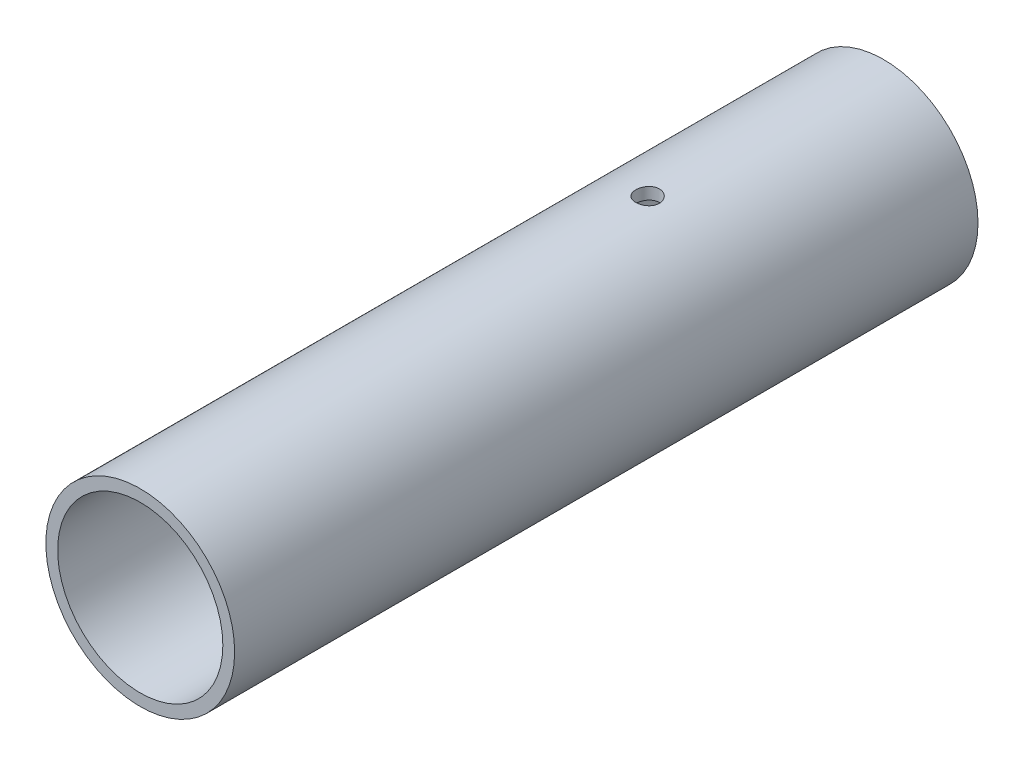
ISO-10303-21;
HEADER;
FILE_DESCRIPTION(('STEP AP214'),'2;1');
FILE_NAME('part.step','',(''),(''),'','','');
FILE_SCHEMA(('AUTOMOTIVE_DESIGN { 1 0 10303 214 1 1 1 1 }'));
ENDSEC;
DATA;
#1=APPLICATION_CONTEXT('core data for automotive mechanical design processes');
#2=APPLICATION_PROTOCOL_DEFINITION('international standard','automotive_design',2000,#1);
#3=PRODUCT_CONTEXT('',#1,'mechanical');
#4=PRODUCT('Part','Part','',(#3));
#5=PRODUCT_RELATED_PRODUCT_CATEGORY('part','',(#4));
#6=PRODUCT_DEFINITION_FORMATION('','',#4);
#7=PRODUCT_DEFINITION_CONTEXT('part definition',#1,'design');
#8=PRODUCT_DEFINITION('design','',#6,#7);
#9=PRODUCT_DEFINITION_SHAPE('','',#8);
#10=(LENGTH_UNIT() NAMED_UNIT(*) SI_UNIT(.MILLI.,.METRE.));
#11=(NAMED_UNIT(*) PLANE_ANGLE_UNIT() SI_UNIT($,.RADIAN.));
#12=(NAMED_UNIT(*) SI_UNIT($,.STERADIAN.) SOLID_ANGLE_UNIT());
#13=UNCERTAINTY_MEASURE_WITH_UNIT(LENGTH_MEASURE(1.E-05),#10,'distance_accuracy_value','');
#14=(GEOMETRIC_REPRESENTATION_CONTEXT(3) GLOBAL_UNCERTAINTY_ASSIGNED_CONTEXT((#13)) GLOBAL_UNIT_ASSIGNED_CONTEXT((#10,
#11,#12)) REPRESENTATION_CONTEXT('',''));
#15=CARTESIAN_POINT('',(0.,0.,0.));
#16=DIRECTION('',(0.,0.,1.));
#17=DIRECTION('',(1.,0.,0.));
#18=AXIS2_PLACEMENT_3D('',#15,#16,#17);
#19=CARTESIAN_POINT('',(0.,0.,63.));
#20=DIRECTION('',(0.,0.,1.));
#21=DIRECTION('',(1.,0.,0.));
#22=AXIS2_PLACEMENT_3D('',#19,#20,#21);
#23=PLANE('',#22);
#24=CARTESIAN_POINT('',(0.,0.,63.));
#25=DIRECTION('',(0.,0.,1.));
#26=DIRECTION('',(1.,0.,0.));
#27=AXIS2_PLACEMENT_3D('',#24,#25,#26);
#28=CIRCLE('',#27,8.);
#29=CARTESIAN_POINT('',(8.,0.,63.));
#30=VERTEX_POINT('',#29);
#31=EDGE_CURVE('E10',#30,#30,#28,.T.);
#32=ORIENTED_EDGE('',*,*,#31,.T.);
#33=EDGE_LOOP('',(#32));
#34=FACE_BOUND('',#33,.T.);
#35=CARTESIAN_POINT('',(0.,0.,63.));
#36=DIRECTION('',(0.,0.,1.));
#37=DIRECTION('',(1.,0.,0.));
#38=AXIS2_PLACEMENT_3D('',#35,#36,#37);
#39=CIRCLE('',#38,7.);
#40=CARTESIAN_POINT('',(7.,0.,63.));
#41=VERTEX_POINT('',#40);
#42=EDGE_CURVE('E48',#41,#41,#39,.T.);
#43=ORIENTED_EDGE('',*,*,#42,.F.);
#44=EDGE_LOOP('',(#43));
#45=FACE_BOUND('',#44,.T.);
#46=ADVANCED_FACE('F30',(#34,#45),#23,.T.);
#47=CARTESIAN_POINT('',(0.,0.,0.));
#48=DIRECTION('',(0.,0.,1.));
#49=DIRECTION('',(1.,0.,0.));
#50=AXIS2_PLACEMENT_3D('',#47,#48,#49);
#51=PLANE('',#50);
#52=CARTESIAN_POINT('',(0.,0.,0.));
#53=DIRECTION('',(0.,0.,1.));
#54=DIRECTION('',(1.,0.,0.));
#55=AXIS2_PLACEMENT_3D('',#52,#53,#54);
#56=CIRCLE('',#55,8.);
#57=CARTESIAN_POINT('',(8.00000000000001,0.,0.));
#58=VERTEX_POINT('',#57);
#59=EDGE_CURVE('E43',#58,#58,#56,.T.);
#60=ORIENTED_EDGE('',*,*,#59,.F.);
#61=EDGE_LOOP('',(#60));
#62=FACE_BOUND('',#61,.T.);
#63=CARTESIAN_POINT('',(0.,0.,0.));
#64=DIRECTION('',(0.,0.,1.));
#65=DIRECTION('',(1.,0.,0.));
#66=AXIS2_PLACEMENT_3D('',#63,#64,#65);
#67=CIRCLE('',#66,7.);
#68=CARTESIAN_POINT('',(7.00000000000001,0.,0.));
#69=VERTEX_POINT('',#68);
#70=EDGE_CURVE('E77',#69,#69,#67,.T.);
#71=ORIENTED_EDGE('',*,*,#70,.T.);
#72=EDGE_LOOP('',(#71));
#73=FACE_BOUND('',#72,.T.);
#74=ADVANCED_FACE('F85',(#62,#73),#51,.F.);
#75=CARTESIAN_POINT('',(0.,0.,63.));
#76=DIRECTION('',(0.,0.,-1.));
#77=DIRECTION('',(-1.,0.,0.));
#78=AXIS2_PLACEMENT_3D('',#75,#76,#77);
#79=CYLINDRICAL_SURFACE('',#78,8.);
#80=CARTESIAN_POINT('',(0.,-8.,21.));
#81=CARTESIAN_POINT('',(0.0559364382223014,-7.99999921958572,20.9999976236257));
#82=CARTESIAN_POINT('',(0.111907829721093,-7.99940713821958,20.9952908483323));
#83=CARTESIAN_POINT('',(0.222293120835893,-7.99710216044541,20.9765888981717));
#84=CARTESIAN_POINT('',(0.276705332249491,-7.99538809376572,20.9625840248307));
#85=CARTESIAN_POINT('',(0.382358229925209,-7.99103224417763,20.9257049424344));
#86=CARTESIAN_POINT('',(0.433601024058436,-7.98839108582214,20.9028367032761));
#87=CARTESIAN_POINT('',(0.531511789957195,-7.98247480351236,20.8488930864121));
#88=CARTESIAN_POINT('',(0.578180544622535,-7.97919978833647,20.8178191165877));
#89=CARTESIAN_POINT('',(0.665885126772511,-7.97236128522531,20.7481632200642));
#90=CARTESIAN_POINT('',(0.706892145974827,-7.96879645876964,20.7095451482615));
#91=CARTESIAN_POINT('',(0.781861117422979,-7.96179090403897,20.6259748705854));
#92=CARTESIAN_POINT('',(0.815822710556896,-7.95835018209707,20.5810223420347));
#93=CARTESIAN_POINT('',(0.875844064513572,-7.95196922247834,20.4858720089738));
#94=CARTESIAN_POINT('',(0.901876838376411,-7.94903070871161,20.4356570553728));
#95=CARTESIAN_POINT('',(0.945129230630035,-7.9440045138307,20.3315251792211));
#96=CARTESIAN_POINT('',(0.962349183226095,-7.94191680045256,20.2776083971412));
#97=CARTESIAN_POINT('',(0.987399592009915,-7.93884135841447,20.1679023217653));
#98=CARTESIAN_POINT('',(0.995278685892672,-7.93784793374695,20.1121242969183));
#99=CARTESIAN_POINT('',(1.00157421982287,-7.93705611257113,20.0000294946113));
#100=CARTESIAN_POINT('',(0.999991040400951,-7.93725766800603,19.9437127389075));
#101=CARTESIAN_POINT('',(0.987446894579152,-7.93882782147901,19.8324780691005));
#102=CARTESIAN_POINT('',(0.976539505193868,-7.94018975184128,19.7775540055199));
#103=CARTESIAN_POINT('',(0.945740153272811,-7.94391679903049,19.6703219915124));
#104=CARTESIAN_POINT('',(0.925848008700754,-7.94628193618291,19.6180140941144));
#105=CARTESIAN_POINT('',(0.877586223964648,-7.95175646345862,19.5173328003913));
#106=CARTESIAN_POINT('',(0.849193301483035,-7.95486789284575,19.4689706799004));
#107=CARTESIAN_POINT('',(0.784752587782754,-7.96148284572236,19.3776773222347));
#108=CARTESIAN_POINT('',(0.748704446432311,-7.96498638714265,19.3347463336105));
#109=CARTESIAN_POINT('',(0.669679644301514,-7.9720204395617,19.2552229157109));
#110=CARTESIAN_POINT('',(0.626656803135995,-7.97555096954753,19.2186763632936));
#111=CARTESIAN_POINT('',(0.535062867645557,-7.98221853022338,19.1533164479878));
#112=CARTESIAN_POINT('',(0.486491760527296,-7.98535556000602,19.1245031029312));
#113=CARTESIAN_POINT('',(0.385144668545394,-7.99088460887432,19.0754274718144));
#114=CARTESIAN_POINT('',(0.332367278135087,-7.99327637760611,19.0551680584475));
#115=CARTESIAN_POINT('',(0.224123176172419,-7.99704314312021,19.0238118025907));
#116=CARTESIAN_POINT('',(0.168656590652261,-7.99841818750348,19.0127145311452));
#117=CARTESIAN_POINT('',(0.0570052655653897,-7.99999038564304,19.0000570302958));
#118=CARTESIAN_POINT('',(0.000827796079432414,-8.00019534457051,18.9984336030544));
#119=CARTESIAN_POINT('',(-0.110998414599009,-7.99942535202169,19.0046030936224));
#120=CARTESIAN_POINT('',(-0.166647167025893,-7.99845042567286,19.0123958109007));
#121=CARTESIAN_POINT('',(-0.275649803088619,-7.99543507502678,19.0371238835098));
#122=CARTESIAN_POINT('',(-0.329010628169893,-7.99339816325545,19.0540291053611));
#123=CARTESIAN_POINT('',(-0.43213986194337,-7.98848689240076,19.0964709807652));
#124=CARTESIAN_POINT('',(-0.481908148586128,-7.98561250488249,19.1220079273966));
#125=CARTESIAN_POINT('',(-0.57672180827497,-7.97932729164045,19.181141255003));
#126=CARTESIAN_POINT('',(-0.621741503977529,-7.97591377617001,19.2147785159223));
#127=CARTESIAN_POINT('',(-0.705518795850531,-7.9689405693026,19.2890997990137));
#128=CARTESIAN_POINT('',(-0.744276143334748,-7.96538087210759,19.3297841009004));
#129=CARTESIAN_POINT('',(-0.814652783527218,-7.95849242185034,19.4173229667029));
#130=CARTESIAN_POINT('',(-0.84623018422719,-7.95516509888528,19.4642113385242));
#131=CARTESIAN_POINT('',(-0.901061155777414,-7.94914164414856,19.5626632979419));
#132=CARTESIAN_POINT('',(-0.924314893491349,-7.94644549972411,19.6142267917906));
#133=CARTESIAN_POINT('',(-0.961770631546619,-7.94199940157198,19.7204301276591));
#134=CARTESIAN_POINT('',(-0.975996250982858,-7.94024698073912,19.7750615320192));
#135=CARTESIAN_POINT('',(-0.995067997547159,-7.93787966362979,19.8859609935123));
#136=CARTESIAN_POINT('',(-0.99991456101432,-7.93726471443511,19.9422289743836));
#137=CARTESIAN_POINT('',(-1.00008261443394,-7.93724350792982,20.0543875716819));
#138=CARTESIAN_POINT('',(-0.995469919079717,-7.93782889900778,20.1102780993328));
#139=CARTESIAN_POINT('',(-0.976989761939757,-7.94012445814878,20.220482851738));
#140=CARTESIAN_POINT('',(-0.963122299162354,-7.94183462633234,20.2747970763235));
#141=CARTESIAN_POINT('',(-0.926546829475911,-7.94618446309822,20.3802987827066));
#142=CARTESIAN_POINT('',(-0.903841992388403,-7.94882379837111,20.4314873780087));
#143=CARTESIAN_POINT('',(-0.850242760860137,-7.95473513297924,20.5293386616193));
#144=CARTESIAN_POINT('',(-0.819348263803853,-7.95800714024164,20.5760012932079));
#145=CARTESIAN_POINT('',(-0.750002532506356,-7.96484241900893,20.6638124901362));
#146=CARTESIAN_POINT('',(-0.711502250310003,-7.9684074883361,20.704922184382));
#147=CARTESIAN_POINT('',(-0.628140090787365,-7.97541132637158,20.7801227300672));
#148=CARTESIAN_POINT('',(-0.583276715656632,-7.97885006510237,20.8142119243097));
#149=CARTESIAN_POINT('',(-0.488266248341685,-7.98522822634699,20.8745141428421));
#150=CARTESIAN_POINT('',(-0.438099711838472,-7.98816570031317,20.9006967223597));
#151=CARTESIAN_POINT('',(-0.33407316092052,-7.99319059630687,20.9442284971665));
#152=CARTESIAN_POINT('',(-0.280217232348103,-7.99527894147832,20.9615872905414));
#153=CARTESIAN_POINT('',(-0.188402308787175,-7.99786688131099,20.9828237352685));
#154=CARTESIAN_POINT('',(-0.15102226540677,-7.99866290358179,20.9892555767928));
#155=CARTESIAN_POINT('',(-0.0757668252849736,-7.99972972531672,20.9978444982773));
#156=CARTESIAN_POINT('',(-0.0378914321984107,-8.00000052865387,21.0000016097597));
#157=CARTESIAN_POINT('',(0.,-8.,21.));
#158=B_SPLINE_CURVE_WITH_KNOTS('',3,(#80,#81,#82,#83,#84,#85,#86,#87,#88,#89,#90,#91,#92,#93,
#94,#95,#96,#97,#98,#99,#100,#101,#102,#103,#104,#105,#106,#107,#108,#109,#110,#111,#112,#113,
#114,#115,#116,#117,#118,#119,#120,#121,#122,#123,#124,#125,#126,#127,#128,#129,#130,#131,#132,
#133,#134,#135,#136,#137,#138,#139,#140,#141,#142,#143,#144,#145,#146,#147,#148,#149,#150,#151,
#152,#153,#154,#155,#156,#157),.UNSPECIFIED.,.T.,.F.,(4,2,2,2,2,2,2,2,2,2,2,2,2,2,2,2,2,2,2,2,2,
2,2,2,2,2,2,2,2,2,2,2,2,2,2,2,2,2,4),(0.,0.167670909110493,0.335516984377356,0.503250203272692,
0.670954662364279,0.839483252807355,1.00802043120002,1.17712500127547,1.34622315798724,
1.51443690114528,1.68264387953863,1.84989078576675,2.01714108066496,2.18485370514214,
2.35257400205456,2.52145391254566,2.69033421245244,2.85927118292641,3.02820024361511,
3.19600111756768,3.36379841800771,3.53104421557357,3.69829569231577,3.86640961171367,
4.03453020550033,4.20360788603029,4.37268217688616,4.5413122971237,4.70993457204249,
4.87738760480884,5.04484065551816,5.21223369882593,5.37962883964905,5.54814095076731,
5.71669279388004,5.88588561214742,6.05489399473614,6.16847537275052,6.28205591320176),.UNSPECIFIED.);
#159=CARTESIAN_POINT('',(0.,-8.,21.));
#160=VERTEX_POINT('',#159);
#161=EDGE_CURVE('E72',#160,#160,#158,.T.);
#162=ORIENTED_EDGE('',*,*,#161,.T.);
#163=EDGE_LOOP('',(#162));
#164=FACE_BOUND('',#163,.T.);
#165=CARTESIAN_POINT('',(0.,8.00000000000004,21.));
#166=CARTESIAN_POINT('',(-0.0559364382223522,7.99999921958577,20.9999976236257));
#167=CARTESIAN_POINT('',(-0.111907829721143,7.99940713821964,20.9952908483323));
#168=CARTESIAN_POINT('',(-0.222293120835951,7.99710216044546,20.9765888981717));
#169=CARTESIAN_POINT('',(-0.276705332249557,7.99538809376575,20.9625840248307));
#170=CARTESIAN_POINT('',(-0.382358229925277,7.99103224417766,20.9257049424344));
#171=CARTESIAN_POINT('',(-0.433601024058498,7.98839108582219,20.9028367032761));
#172=CARTESIAN_POINT('',(-0.531511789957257,7.98247480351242,20.8488930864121));
#173=CARTESIAN_POINT('',(-0.578180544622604,7.97919978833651,20.8178191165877));
#174=CARTESIAN_POINT('',(-0.665885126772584,7.97236128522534,20.7481632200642));
#175=CARTESIAN_POINT('',(-0.706892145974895,7.96879645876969,20.7095451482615));
#176=CARTESIAN_POINT('',(-0.781861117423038,7.96179090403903,20.6259748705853));
#177=CARTESIAN_POINT('',(-0.815822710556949,7.95835018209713,20.5810223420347));
#178=CARTESIAN_POINT('',(-0.875844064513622,7.95196922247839,20.4858720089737));
#179=CARTESIAN_POINT('',(-0.901876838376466,7.94903070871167,20.4356570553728));
#180=CARTESIAN_POINT('',(-0.945129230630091,7.94400451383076,20.331525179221));
#181=CARTESIAN_POINT('',(-0.962349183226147,7.94191680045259,20.2776083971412));
#182=CARTESIAN_POINT('',(-0.987399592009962,7.93884135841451,20.1679023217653));
#183=CARTESIAN_POINT('',(-0.995278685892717,7.93784793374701,20.1121242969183));
#184=CARTESIAN_POINT('',(-1.00157421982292,7.93705611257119,20.0000294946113));
#185=CARTESIAN_POINT('',(-0.999991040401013,7.93725766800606,19.9437127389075));
#186=CARTESIAN_POINT('',(-0.987446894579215,7.93882782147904,19.8324780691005));
#187=CARTESIAN_POINT('',(-0.976539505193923,7.94018975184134,19.7775540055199));
#188=CARTESIAN_POINT('',(-0.945740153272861,7.94391679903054,19.6703219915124));
#189=CARTESIAN_POINT('',(-0.925848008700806,7.94628193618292,19.6180140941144));
#190=CARTESIAN_POINT('',(-0.877586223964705,7.95175646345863,19.5173328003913));
#191=CARTESIAN_POINT('',(-0.849193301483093,7.9548678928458,19.4689706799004));
#192=CARTESIAN_POINT('',(-0.784752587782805,7.96148284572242,19.3776773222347));
#193=CARTESIAN_POINT('',(-0.748704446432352,7.96498638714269,19.3347463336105));
#194=CARTESIAN_POINT('',(-0.669679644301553,7.97202043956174,19.2552229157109));
#195=CARTESIAN_POINT('',(-0.626656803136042,7.9755509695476,19.2186763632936));
#196=CARTESIAN_POINT('',(-0.535062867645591,7.98221853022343,19.1533164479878));
#197=CARTESIAN_POINT('',(-0.486491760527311,7.98535556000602,19.1245031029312));
#198=CARTESIAN_POINT('',(-0.385144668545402,7.99088460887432,19.0754274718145));
#199=CARTESIAN_POINT('',(-0.332367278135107,7.99327637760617,19.0551680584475));
#200=CARTESIAN_POINT('',(-0.224123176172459,7.99704314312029,19.0238118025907));
#201=CARTESIAN_POINT('',(-0.168656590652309,7.99841818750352,19.0127145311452));
#202=CARTESIAN_POINT('',(-0.0570052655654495,7.99999038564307,19.0000570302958));
#203=CARTESIAN_POINT('',(-0.000827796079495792,8.00019534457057,18.9984336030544));
#204=CARTESIAN_POINT('',(0.110998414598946,7.99942535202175,19.0046030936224));
#205=CARTESIAN_POINT('',(0.166647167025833,7.99845042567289,19.0123958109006));
#206=CARTESIAN_POINT('',(0.275649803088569,7.99543507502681,19.0371238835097));
#207=CARTESIAN_POINT('',(0.329010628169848,7.99339816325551,19.054029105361));
#208=CARTESIAN_POINT('',(0.432139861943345,7.98848689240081,19.0964709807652));
#209=CARTESIAN_POINT('',(0.481908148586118,7.9856125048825,19.1220079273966));
#210=CARTESIAN_POINT('',(0.576721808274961,7.97932729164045,19.181141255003));
#211=CARTESIAN_POINT('',(0.621741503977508,7.97591377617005,19.2147785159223));
#212=CARTESIAN_POINT('',(0.705518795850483,7.96894056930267,19.2890997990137));
#213=CARTESIAN_POINT('',(0.744276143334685,7.96538087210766,19.3297841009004));
#214=CARTESIAN_POINT('',(0.814652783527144,7.95849242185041,19.4173229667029));
#215=CARTESIAN_POINT('',(0.846230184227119,7.95516509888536,19.4642113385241));
#216=CARTESIAN_POINT('',(0.901061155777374,7.94914164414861,19.5626632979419));
#217=CARTESIAN_POINT('',(0.924314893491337,7.94644549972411,19.6142267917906));
#218=CARTESIAN_POINT('',(0.961770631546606,7.94199940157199,19.720430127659));
#219=CARTESIAN_POINT('',(0.975996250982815,7.94024698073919,19.7750615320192));
#220=CARTESIAN_POINT('',(0.9950679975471,7.93787966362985,19.8859609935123));
#221=CARTESIAN_POINT('',(0.999914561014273,7.93726471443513,19.9422289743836));
#222=CARTESIAN_POINT('',(1.00008261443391,7.93724350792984,20.0543875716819));
#223=CARTESIAN_POINT('',(0.99546991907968,7.93782889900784,20.1102780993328));
#224=CARTESIAN_POINT('',(0.976989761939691,7.94012445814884,20.220482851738));
#225=CARTESIAN_POINT('',(0.963122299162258,7.94183462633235,20.2747970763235));
#226=CARTESIAN_POINT('',(0.926546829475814,7.94618446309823,20.3802987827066));
#227=CARTESIAN_POINT('',(0.903841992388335,7.94882379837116,20.4314873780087));
#228=CARTESIAN_POINT('',(0.850242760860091,7.95473513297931,20.5293386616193));
#229=CARTESIAN_POINT('',(0.819348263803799,7.95800714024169,20.5760012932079));
#230=CARTESIAN_POINT('',(0.750002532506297,7.96484241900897,20.6638124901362));
#231=CARTESIAN_POINT('',(0.711502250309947,7.96840748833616,20.704922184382));
#232=CARTESIAN_POINT('',(0.628140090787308,7.97541132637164,20.7801227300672));
#233=CARTESIAN_POINT('',(0.583276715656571,7.97885006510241,20.8142119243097));
#234=CARTESIAN_POINT('',(0.488266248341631,7.98522822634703,20.8745141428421));
#235=CARTESIAN_POINT('',(0.438099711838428,7.98816570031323,20.9006967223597));
#236=CARTESIAN_POINT('',(0.334073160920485,7.99319059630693,20.9442284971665));
#237=CARTESIAN_POINT('',(0.280217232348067,7.99527894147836,20.9615872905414));
#238=CARTESIAN_POINT('',(0.188402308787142,7.99786688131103,20.9828237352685));
#239=CARTESIAN_POINT('',(0.151022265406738,7.99866290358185,20.9892555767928));
#240=CARTESIAN_POINT('',(0.0757668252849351,7.99972972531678,20.9978444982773));
#241=CARTESIAN_POINT('',(0.0378914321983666,8.00000052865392,21.0000016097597));
#242=CARTESIAN_POINT('',(0.,8.00000000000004,21.));
#243=B_SPLINE_CURVE_WITH_KNOTS('',3,(#165,#166,#167,#168,#169,#170,#171,#172,#173,#174,#175,
#176,#177,#178,#179,#180,#181,#182,#183,#184,#185,#186,#187,#188,#189,#190,#191,#192,#193,#194,
#195,#196,#197,#198,#199,#200,#201,#202,#203,#204,#205,#206,#207,#208,#209,#210,#211,#212,#213,
#214,#215,#216,#217,#218,#219,#220,#221,#222,#223,#224,#225,#226,#227,#228,#229,#230,#231,#232,
#233,#234,#235,#236,#237,#238,#239,#240,#241,#242),.UNSPECIFIED.,.T.,.F.,(4,2,2,2,2,2,2,2,2,2,2,
2,2,2,2,2,2,2,2,2,2,2,2,2,2,2,2,2,2,2,2,2,2,2,2,2,2,2,4),(0.,0.167670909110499,
0.335516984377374,0.50325020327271,0.670954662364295,0.839483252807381,1.00802043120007,
1.17712500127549,1.34622315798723,1.51443690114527,1.68264387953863,1.84989078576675,
2.01714108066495,2.18485370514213,2.35257400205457,2.52145391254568,2.69033421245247,
2.85927118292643,3.02820024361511,3.19600111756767,3.3637984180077,3.5310442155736,
3.69829569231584,3.8664096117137,4.03453020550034,4.20360788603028,4.37268217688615,
4.54131229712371,4.70993457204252,4.87738760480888,5.0448406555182,5.21223369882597,
5.37962883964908,5.54814095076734,5.71669279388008,5.88588561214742,6.05489399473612,
6.16847537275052,6.28205591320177),.UNSPECIFIED.);
#244=CARTESIAN_POINT('',(0.,8.00000000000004,21.));
#245=VERTEX_POINT('',#244);
#246=EDGE_CURVE('E68',#245,#245,#243,.T.);
#247=ORIENTED_EDGE('',*,*,#246,.T.);
#248=EDGE_LOOP('',(#247));
#249=FACE_BOUND('',#248,.T.);
#250=ORIENTED_EDGE('',*,*,#31,.F.);
#251=EDGE_LOOP('',(#250));
#252=FACE_BOUND('',#251,.T.);
#253=ORIENTED_EDGE('',*,*,#59,.T.);
#254=EDGE_LOOP('',(#253));
#255=FACE_BOUND('',#254,.T.);
#256=ADVANCED_FACE('F32',(#164,#249,#252,#255),#79,.T.);
#257=CARTESIAN_POINT('',(0.,0.,63.));
#258=DIRECTION('',(0.,0.,-1.));
#259=DIRECTION('',(-1.,0.,0.));
#260=AXIS2_PLACEMENT_3D('',#257,#258,#259);
#261=CYLINDRICAL_SURFACE('',#260,7.);
#262=CARTESIAN_POINT('',(0.,-7.,21.));
#263=CARTESIAN_POINT('',(0.0558653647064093,-6.99999913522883,20.9999976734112));
#264=CARTESIAN_POINT('',(0.111763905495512,-6.99932420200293,20.9953027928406));
#265=CARTESIAN_POINT('',(0.22200066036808,-6.99669670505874,20.976650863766));
#266=CARTESIAN_POINT('',(0.276337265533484,-6.99474286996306,20.9626845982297));
#267=CARTESIAN_POINT('',(0.381838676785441,-6.98977730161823,20.9259139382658));
#268=CARTESIAN_POINT('',(0.433005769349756,-6.98676634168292,20.9031160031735));
#269=CARTESIAN_POINT('',(0.530779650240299,-6.98001989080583,20.8493444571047));
#270=CARTESIAN_POINT('',(0.577387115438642,-6.97628450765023,20.8183720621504));
#271=CARTESIAN_POINT('',(0.665058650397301,-6.96847539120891,20.7488958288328));
#272=CARTESIAN_POINT('',(0.706085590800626,-6.96439965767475,20.7103453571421));
#273=CARTESIAN_POINT('',(0.781111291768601,-6.95638499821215,20.6269075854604));
#274=CARTESIAN_POINT('',(0.815109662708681,-6.95244607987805,20.5820199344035));
#275=CARTESIAN_POINT('',(0.875255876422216,-6.94513156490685,20.4869348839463));
#276=CARTESIAN_POINT('',(0.901368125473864,-6.94175855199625,20.4367147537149));
#277=CARTESIAN_POINT('',(0.944773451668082,-6.93598482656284,20.332545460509));
#278=CARTESIAN_POINT('',(0.962066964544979,-6.93358406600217,20.2785964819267));
#279=CARTESIAN_POINT('',(0.987229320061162,-6.93004619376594,20.168889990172));
#280=CARTESIAN_POINT('',(0.995161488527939,-6.928900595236,20.1131472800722));
#281=CARTESIAN_POINT('',(1.00157210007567,-6.92797693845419,20.0011110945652));
#282=CARTESIAN_POINT('',(1.00005103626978,-6.92819880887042,19.9448176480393));
#283=CARTESIAN_POINT('',(0.987650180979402,-6.92997725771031,19.833723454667));
#284=CARTESIAN_POINT('',(0.976840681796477,-6.93152381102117,19.7789146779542));
#285=CARTESIAN_POINT('',(0.946279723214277,-6.93576171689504,19.6718969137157));
#286=CARTESIAN_POINT('',(0.926528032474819,-6.93845309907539,19.6196879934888));
#287=CARTESIAN_POINT('',(0.87856952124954,-6.94468857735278,19.5191367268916));
#288=CARTESIAN_POINT('',(0.850332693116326,-6.94823569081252,19.4708088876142));
#289=CARTESIAN_POINT('',(0.786226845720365,-6.95578073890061,19.3795507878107));
#290=CARTESIAN_POINT('',(0.750357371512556,-6.95977870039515,19.3366208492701));
#291=CARTESIAN_POINT('',(0.671617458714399,-6.9678193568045,19.2569695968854));
#292=CARTESIAN_POINT('',(0.62868653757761,-6.9718621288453,19.2203080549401));
#293=CARTESIAN_POINT('',(0.537249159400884,-6.97950317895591,19.1547014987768));
#294=CARTESIAN_POINT('',(0.488742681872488,-6.98310145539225,19.1257565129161));
#295=CARTESIAN_POINT('',(0.387481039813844,-6.9894513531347,19.0764025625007));
#296=CARTESIAN_POINT('',(0.334723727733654,-6.99220254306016,19.0559979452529));
#297=CARTESIAN_POINT('',(0.226483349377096,-6.99654459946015,19.0243545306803));
#298=CARTESIAN_POINT('',(0.171000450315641,-6.99813553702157,19.0131151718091));
#299=CARTESIAN_POINT('',(0.0594000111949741,-6.99996847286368,19.0002001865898));
#300=CARTESIAN_POINT('',(0.00329216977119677,-7.00022206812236,18.9984423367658));
#301=CARTESIAN_POINT('',(-0.108417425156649,-6.99938323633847,19.0043224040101));
#302=CARTESIAN_POINT('',(-0.164019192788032,-6.99829084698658,19.0119600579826));
#303=CARTESIAN_POINT('',(-0.272891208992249,-6.99488996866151,19.0363459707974));
#304=CARTESIAN_POINT('',(-0.326170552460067,-6.99258679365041,19.0530544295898));
#305=CARTESIAN_POINT('',(-0.429171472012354,-6.98702187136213,19.0950658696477));
#306=CARTESIAN_POINT('',(-0.47889289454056,-6.98376008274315,19.1203692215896));
#307=CARTESIAN_POINT('',(-0.573729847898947,-6.97661188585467,19.1790469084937));
#308=CARTESIAN_POINT('',(-0.618812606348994,-6.97272147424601,19.2124737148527));
#309=CARTESIAN_POINT('',(-0.702757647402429,-6.96476223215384,19.2863760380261));
#310=CARTESIAN_POINT('',(-0.741619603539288,-6.96069339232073,19.3268519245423));
#311=CARTESIAN_POINT('',(-0.812316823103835,-6.95279940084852,19.4140683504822));
#312=CARTESIAN_POINT('',(-0.844097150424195,-6.94897630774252,19.4608536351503));
#313=CARTESIAN_POINT('',(-0.89934784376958,-6.94204235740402,19.559146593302));
#314=CARTESIAN_POINT('',(-0.922818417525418,-6.93893148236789,19.6106541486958));
#315=CARTESIAN_POINT('',(-0.960697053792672,-6.9337888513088,19.7167616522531));
#316=CARTESIAN_POINT('',(-0.975134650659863,-6.93175358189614,19.7713508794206));
#317=CARTESIAN_POINT('',(-0.994631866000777,-6.92898304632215,19.8822102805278));
#318=CARTESIAN_POINT('',(-0.999692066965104,-6.92824769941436,19.9384803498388));
#319=CARTESIAN_POINT('',(-1.00027795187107,-6.92816308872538,20.0505569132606));
#320=CARTESIAN_POINT('',(-0.995889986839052,-6.92880127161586,20.1063629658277));
#321=CARTESIAN_POINT('',(-0.977888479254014,-6.93136462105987,20.2164350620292));
#322=CARTESIAN_POINT('',(-0.964274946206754,-6.93328978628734,20.2707011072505));
#323=CARTESIAN_POINT('',(-0.928238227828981,-6.93820594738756,20.3761326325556));
#324=CARTESIAN_POINT('',(-0.905820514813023,-6.94119628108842,20.4273000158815));
#325=CARTESIAN_POINT('',(-0.852820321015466,-6.94790672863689,20.5251612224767));
#326=CARTESIAN_POINT('',(-0.822237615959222,-6.95162686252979,20.5718549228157));
#327=CARTESIAN_POINT('',(-0.753459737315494,-6.95941831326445,20.6598829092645));
#328=CARTESIAN_POINT('',(-0.71520046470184,-6.96349241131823,20.7011668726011));
#329=CARTESIAN_POINT('',(-0.632290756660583,-6.97150911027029,20.7767598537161));
#330=CARTESIAN_POINT('',(-0.587638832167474,-6.97545168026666,20.8110672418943));
#331=CARTESIAN_POINT('',(-0.492951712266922,-6.98278331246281,20.8718837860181));
#332=CARTESIAN_POINT('',(-0.442890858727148,-6.98616952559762,20.898353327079));
#333=CARTESIAN_POINT('',(-0.339010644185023,-6.9919787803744,20.9424698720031));
#334=CARTESIAN_POINT('',(-0.285195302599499,-6.99440283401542,20.9601261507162));
#335=CARTESIAN_POINT('',(-0.19260568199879,-6.99745181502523,20.9820417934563));
#336=CARTESIAN_POINT('',(-0.154406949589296,-6.99840255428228,20.9887660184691));
#337=CARTESIAN_POINT('',(-0.0774774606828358,-6.99967694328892,20.9977459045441));
#338=CARTESIAN_POINT('',(-0.0387467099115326,-7.00000059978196,21.0000016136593));
#339=CARTESIAN_POINT('',(0.,-7.,21.));
#340=B_SPLINE_CURVE_WITH_KNOTS('',3,(#262,#263,#264,#265,#266,#267,#268,#269,#270,#271,#272,
#273,#274,#275,#276,#277,#278,#279,#280,#281,#282,#283,#284,#285,#286,#287,#288,#289,#290,#291,
#292,#293,#294,#295,#296,#297,#298,#299,#300,#301,#302,#303,#304,#305,#306,#307,#308,#309,#310,
#311,#312,#313,#314,#315,#316,#317,#318,#319,#320,#321,#322,#323,#324,#325,#326,#327,#328,#329,
#330,#331,#332,#333,#334,#335,#336,#337,#338,#339),.UNSPECIFIED.,.T.,.F.,(4,2,2,2,2,2,2,2,2,2,2,
2,2,2,2,2,2,2,2,2,2,2,2,2,2,2,2,2,2,2,2,2,2,2,2,2,2,2,4),(0.,0.167454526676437,
0.335075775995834,0.502574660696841,0.670048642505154,0.838587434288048,1.00713556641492,
1.17643344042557,1.34572294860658,1.51386059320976,1.68198946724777,1.84885708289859,
2.01572901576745,2.18319817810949,2.35067732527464,2.51967378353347,2.68867086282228,
2.8577538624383,3.02682650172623,3.19443056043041,3.36202992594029,3.5288997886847,
3.69577684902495,3.86376187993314,4.03175572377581,4.20101062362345,4.37026129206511,
4.53895564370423,4.70763951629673,4.8747882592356,5.0419368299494,5.2089816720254,
5.37603110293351,5.54453823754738,5.7130846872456,5.88246902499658,6.05167472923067,
6.16781792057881,6.28395986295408),.UNSPECIFIED.);
#341=CARTESIAN_POINT('',(0.,-7.,21.));
#342=VERTEX_POINT('',#341);
#343=EDGE_CURVE('E35',#342,#342,#340,.T.);
#344=ORIENTED_EDGE('',*,*,#343,.F.);
#345=EDGE_LOOP('',(#344));
#346=FACE_BOUND('',#345,.T.);
#347=CARTESIAN_POINT('',(0.,7.00000000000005,21.));
#348=CARTESIAN_POINT('',(-0.0558653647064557,6.99999913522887,20.9999976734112));
#349=CARTESIAN_POINT('',(-0.111763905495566,6.99932420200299,20.9953027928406));
#350=CARTESIAN_POINT('',(-0.222000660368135,6.9966967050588,20.976650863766));
#351=CARTESIAN_POINT('',(-0.276337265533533,6.99474286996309,20.9626845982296));
#352=CARTESIAN_POINT('',(-0.381838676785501,6.98977730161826,20.9259139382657));
#353=CARTESIAN_POINT('',(-0.433005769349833,6.98676634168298,20.9031160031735));
#354=CARTESIAN_POINT('',(-0.530779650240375,6.98001989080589,20.8493444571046));
#355=CARTESIAN_POINT('',(-0.5773871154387,6.97628450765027,20.8183720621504));
#356=CARTESIAN_POINT('',(-0.66505865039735,6.96847539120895,20.7488958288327));
#357=CARTESIAN_POINT('',(-0.706085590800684,6.9643996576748,20.7103453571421));
#358=CARTESIAN_POINT('',(-0.781111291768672,6.95638499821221,20.6269075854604));
#359=CARTESIAN_POINT('',(-0.815109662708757,6.9524460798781,20.5820199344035));
#360=CARTESIAN_POINT('',(-0.875255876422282,6.9451315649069,20.4869348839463));
#361=CARTESIAN_POINT('',(-0.901368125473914,6.94175855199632,20.4367147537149));
#362=CARTESIAN_POINT('',(-0.944773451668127,6.93598482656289,20.3325454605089));
#363=CARTESIAN_POINT('',(-0.962066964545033,6.9335840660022,20.2785964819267));
#364=CARTESIAN_POINT('',(-0.987229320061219,6.93004619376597,20.168889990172));
#365=CARTESIAN_POINT('',(-0.995161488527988,6.92890059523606,20.1131472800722));
#366=CARTESIAN_POINT('',(-1.00157210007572,6.92797693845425,20.0011110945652));
#367=CARTESIAN_POINT('',(-1.00005103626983,6.92819880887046,19.9448176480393));
#368=CARTESIAN_POINT('',(-0.987650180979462,6.92997725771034,19.8337234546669));
#369=CARTESIAN_POINT('',(-0.976840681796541,6.93152381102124,19.7789146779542));
#370=CARTESIAN_POINT('',(-0.946279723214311,6.93576171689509,19.6718969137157));
#371=CARTESIAN_POINT('',(-0.92652803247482,6.9384530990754,19.6196879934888));
#372=CARTESIAN_POINT('',(-0.878569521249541,6.94468857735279,19.5191367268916));
#373=CARTESIAN_POINT('',(-0.850332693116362,6.94823569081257,19.4708088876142));
#374=CARTESIAN_POINT('',(-0.786226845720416,6.95578073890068,19.3795507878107));
#375=CARTESIAN_POINT('',(-0.750357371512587,6.95977870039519,19.3366208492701));
#376=CARTESIAN_POINT('',(-0.671617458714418,6.96781935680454,19.2569695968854));
#377=CARTESIAN_POINT('',(-0.628686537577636,6.97186212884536,19.22030805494));
#378=CARTESIAN_POINT('',(-0.537249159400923,6.97950317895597,19.1547014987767));
#379=CARTESIAN_POINT('',(-0.488742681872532,6.98310145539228,19.125756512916));
#380=CARTESIAN_POINT('',(-0.387481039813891,6.98945135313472,19.0764025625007));
#381=CARTESIAN_POINT('',(-0.334723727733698,6.99220254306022,19.0559979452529));
#382=CARTESIAN_POINT('',(-0.226483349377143,6.99654459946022,19.0243545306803));
#383=CARTESIAN_POINT('',(-0.171000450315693,6.99813553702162,19.0131151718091));
#384=CARTESIAN_POINT('',(-0.0594000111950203,6.99996847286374,19.0002001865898));
#385=CARTESIAN_POINT('',(-0.0032921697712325,7.00022206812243,18.9984423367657));
#386=CARTESIAN_POINT('',(0.108417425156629,6.99938323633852,19.00432240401));
#387=CARTESIAN_POINT('',(0.164019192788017,6.99829084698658,19.0119600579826));
#388=CARTESIAN_POINT('',(0.272891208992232,6.99488996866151,19.0363459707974));
#389=CARTESIAN_POINT('',(0.326170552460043,6.99258679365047,19.0530544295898));
#390=CARTESIAN_POINT('',(0.429171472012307,6.98702187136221,19.0950658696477));
#391=CARTESIAN_POINT('',(0.478892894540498,6.98376008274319,19.1203692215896));
#392=CARTESIAN_POINT('',(0.573729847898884,6.97661188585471,19.1790469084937));
#393=CARTESIAN_POINT('',(0.618812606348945,6.97272147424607,19.2124737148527));
#394=CARTESIAN_POINT('',(0.702757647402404,6.9647622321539,19.2863760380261));
#395=CARTESIAN_POINT('',(0.741619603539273,6.96069339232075,19.3268519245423));
#396=CARTESIAN_POINT('',(0.812316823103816,6.95279940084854,19.4140683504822));
#397=CARTESIAN_POINT('',(0.844097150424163,6.94897630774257,19.4608536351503));
#398=CARTESIAN_POINT('',(0.899347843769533,6.94204235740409,19.559146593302));
#399=CARTESIAN_POINT('',(0.92281841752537,6.93893148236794,19.6106541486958));
#400=CARTESIAN_POINT('',(0.960697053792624,6.93378885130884,19.7167616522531));
#401=CARTESIAN_POINT('',(0.975134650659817,6.9317535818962,19.7713508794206));
#402=CARTESIAN_POINT('',(0.994631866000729,6.92898304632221,19.8822102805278));
#403=CARTESIAN_POINT('',(0.99969206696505,6.9282476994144,19.9384803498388));
#404=CARTESIAN_POINT('',(1.00027795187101,6.92816308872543,20.0505569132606));
#405=CARTESIAN_POINT('',(0.995889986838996,6.92880127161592,20.1063629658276));
#406=CARTESIAN_POINT('',(0.977888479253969,6.93136462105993,20.2164350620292));
#407=CARTESIAN_POINT('',(0.96427494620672,6.93328978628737,20.2707011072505));
#408=CARTESIAN_POINT('',(0.928238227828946,6.9382059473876,20.3761326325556));
#409=CARTESIAN_POINT('',(0.905820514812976,6.94119628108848,20.4273000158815));
#410=CARTESIAN_POINT('',(0.852820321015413,6.94790672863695,20.5251612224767));
#411=CARTESIAN_POINT('',(0.822237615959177,6.95162686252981,20.5718549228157));
#412=CARTESIAN_POINT('',(0.753459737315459,6.95941831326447,20.6598829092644));
#413=CARTESIAN_POINT('',(0.715200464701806,6.96349241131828,20.7011668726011));
#414=CARTESIAN_POINT('',(0.632290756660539,6.97150911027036,20.7767598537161));
#415=CARTESIAN_POINT('',(0.587638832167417,6.97545168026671,20.8110672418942));
#416=CARTESIAN_POINT('',(0.492951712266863,6.98278331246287,20.8718837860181));
#417=CARTESIAN_POINT('',(0.442890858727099,6.98616952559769,20.8983533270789));
#418=CARTESIAN_POINT('',(0.339010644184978,6.99197878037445,20.9424698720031));
#419=CARTESIAN_POINT('',(0.285195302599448,6.99440283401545,20.9601261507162));
#420=CARTESIAN_POINT('',(0.192605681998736,6.99745181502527,20.9820417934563));
#421=CARTESIAN_POINT('',(0.154406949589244,6.99840255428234,20.9887660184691));
#422=CARTESIAN_POINT('',(0.0774774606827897,6.99967694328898,20.9977459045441));
#423=CARTESIAN_POINT('',(0.0387467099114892,7.00000059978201,21.0000016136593));
#424=CARTESIAN_POINT('',(0.,7.00000000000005,21.));
#425=B_SPLINE_CURVE_WITH_KNOTS('',3,(#347,#348,#349,#350,#351,#352,#353,#354,#355,#356,#357,
#358,#359,#360,#361,#362,#363,#364,#365,#366,#367,#368,#369,#370,#371,#372,#373,#374,#375,#376,
#377,#378,#379,#380,#381,#382,#383,#384,#385,#386,#387,#388,#389,#390,#391,#392,#393,#394,#395,
#396,#397,#398,#399,#400,#401,#402,#403,#404,#405,#406,#407,#408,#409,#410,#411,#412,#413,#414,
#415,#416,#417,#418,#419,#420,#421,#422,#423,#424),.UNSPECIFIED.,.T.,.F.,(4,2,2,2,2,2,2,2,2,2,2,
2,2,2,2,2,2,2,2,2,2,2,2,2,2,2,2,2,2,2,2,2,2,2,2,2,2,2,4),(0.,0.16745452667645,0.335075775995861,
0.502574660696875,0.670048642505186,0.838587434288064,1.00713556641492,1.17643344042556,
1.34572294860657,1.51386059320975,1.68198946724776,1.84885708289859,2.01572901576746,
2.1831981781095,2.35067732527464,2.51967378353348,2.6886708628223,2.8577538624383,
3.02682650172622,3.19443056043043,3.36202992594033,3.52889978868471,3.69577684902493,
3.86376187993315,4.03175572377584,4.20101062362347,4.37026129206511,4.53895564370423,
4.70763951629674,4.8747882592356,5.0419368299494,5.20898167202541,5.3760311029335,
5.54453823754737,5.71308468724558,5.88246902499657,6.05167472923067,6.16781792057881,
6.28395986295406),.UNSPECIFIED.);
#426=CARTESIAN_POINT('',(0.,7.00000000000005,21.));
#427=VERTEX_POINT('',#426);
#428=EDGE_CURVE('E51',#427,#427,#425,.T.);
#429=ORIENTED_EDGE('',*,*,#428,.F.);
#430=EDGE_LOOP('',(#429));
#431=FACE_BOUND('',#430,.T.);
#432=ORIENTED_EDGE('',*,*,#42,.T.);
#433=EDGE_LOOP('',(#432));
#434=FACE_BOUND('',#433,.T.);
#435=ORIENTED_EDGE('',*,*,#70,.F.);
#436=EDGE_LOOP('',(#435));
#437=FACE_BOUND('',#436,.T.);
#438=ADVANCED_FACE('F55',(#346,#431,#434,#437),#261,.F.);
#439=CARTESIAN_POINT('',(0.,-20.,20.));
#440=DIRECTION('',(0.,1.,0.));
#441=DIRECTION('',(0.,0.,1.));
#442=AXIS2_PLACEMENT_3D('',#439,#440,#441);
#443=CYLINDRICAL_SURFACE('',#442,1.);
#444=ORIENTED_EDGE('',*,*,#428,.T.);
#445=EDGE_LOOP('',(#444));
#446=FACE_BOUND('',#445,.T.);
#447=ORIENTED_EDGE('',*,*,#246,.F.);
#448=EDGE_LOOP('',(#447));
#449=FACE_BOUND('',#448,.T.);
#450=ADVANCED_FACE('F61',(#446,#449),#443,.F.);
#451=ORIENTED_EDGE('',*,*,#343,.T.);
#452=EDGE_LOOP('',(#451));
#453=FACE_BOUND('',#452,.T.);
#454=ORIENTED_EDGE('',*,*,#161,.F.);
#455=EDGE_LOOP('',(#454));
#456=FACE_BOUND('',#455,.T.);
#457=ADVANCED_FACE('F58',(#453,#456),#443,.F.);
#458=CLOSED_SHELL('',(#46,#74,#256,#438,#450,#457));
#459=MANIFOLD_SOLID_BREP('B2',#458);
#460=ADVANCED_BREP_SHAPE_REPRESENTATION('',(#18,#459),#14);
#461=SHAPE_DEFINITION_REPRESENTATION(#9,#460);
ENDSEC;
END-ISO-10303-21;
